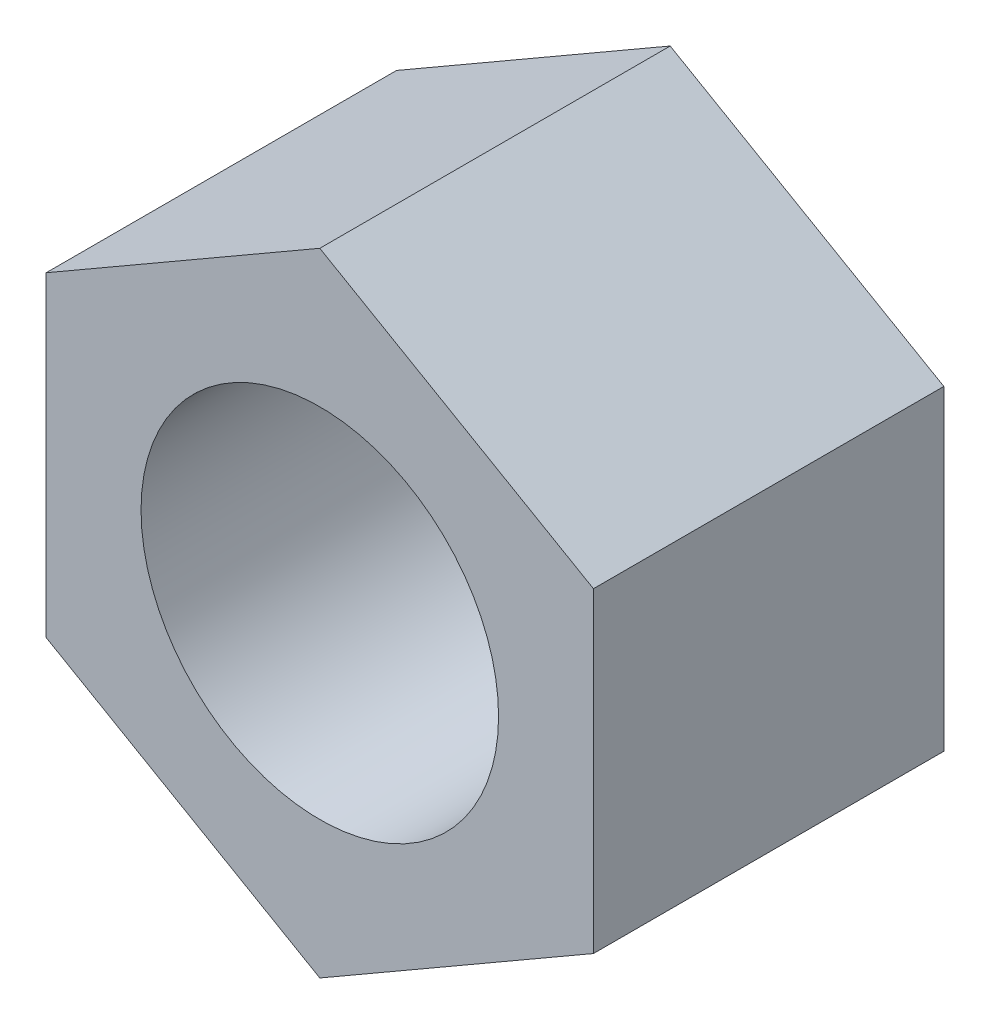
ISO-10303-21;
HEADER;
FILE_DESCRIPTION(('STEP AP214'),'2;1');
FILE_NAME('part.step','',(''),(''),'','','');
FILE_SCHEMA(('AUTOMOTIVE_DESIGN { 1 0 10303 214 1 1 1 1 }'));
ENDSEC;
DATA;
#1=APPLICATION_CONTEXT('core data for automotive mechanical design processes');
#2=APPLICATION_PROTOCOL_DEFINITION('international standard','automotive_design',2000,#1);
#3=PRODUCT_CONTEXT('',#1,'mechanical');
#4=PRODUCT('Part','Part','',(#3));
#5=PRODUCT_RELATED_PRODUCT_CATEGORY('part','',(#4));
#6=PRODUCT_DEFINITION_FORMATION('','',#4);
#7=PRODUCT_DEFINITION_CONTEXT('part definition',#1,'design');
#8=PRODUCT_DEFINITION('design','',#6,#7);
#9=PRODUCT_DEFINITION_SHAPE('','',#8);
#10=(LENGTH_UNIT() NAMED_UNIT(*) SI_UNIT(.MILLI.,.METRE.));
#11=(NAMED_UNIT(*) PLANE_ANGLE_UNIT() SI_UNIT($,.RADIAN.));
#12=(NAMED_UNIT(*) SI_UNIT($,.STERADIAN.) SOLID_ANGLE_UNIT());
#13=UNCERTAINTY_MEASURE_WITH_UNIT(LENGTH_MEASURE(1.E-05),#10,'distance_accuracy_value','');
#14=(GEOMETRIC_REPRESENTATION_CONTEXT(3) GLOBAL_UNCERTAINTY_ASSIGNED_CONTEXT((#13)) GLOBAL_UNIT_ASSIGNED_CONTEXT((#10,
#11,#12)) REPRESENTATION_CONTEXT('',''));
#15=CARTESIAN_POINT('',(0.,0.,0.));
#16=DIRECTION('',(0.,0.,1.));
#17=DIRECTION('',(1.,0.,0.));
#18=AXIS2_PLACEMENT_3D('',#15,#16,#17);
#19=CARTESIAN_POINT('',(0.,0.,56.007));
#20=DIRECTION('',(0.,0.,1.));
#21=DIRECTION('',(1.,0.,0.));
#22=AXIS2_PLACEMENT_3D('',#19,#20,#21);
#23=PLANE('',#22);
#24=DIRECTION('',(0.,1.,0.));
#25=VECTOR('',#24,1.);
#26=CARTESIAN_POINT('',(43.7388,-25.2526079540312,56.007));
#27=LINE('',#26,#25);
#28=CARTESIAN_POINT('',(43.7388,-25.2526079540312,56.007));
#29=VERTEX_POINT('',#28);
#30=CARTESIAN_POINT('',(43.7388,25.2526079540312,56.007));
#31=VERTEX_POINT('',#30);
#32=EDGE_CURVE('E155',#29,#31,#27,.T.);
#33=ORIENTED_EDGE('',*,*,#32,.T.);
#34=DIRECTION('',(-0.866025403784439,0.5,0.));
#35=VECTOR('',#34,1.);
#36=CARTESIAN_POINT('',(43.7388,25.2526079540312,56.007));
#37=LINE('',#36,#35);
#38=CARTESIAN_POINT('',(0.,50.5052159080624,56.007));
#39=VERTEX_POINT('',#38);
#40=EDGE_CURVE('E99',#31,#39,#37,.T.);
#41=ORIENTED_EDGE('',*,*,#40,.T.);
#42=DIRECTION('',(-0.866025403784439,-0.5,0.));
#43=VECTOR('',#42,1.);
#44=CARTESIAN_POINT('',(0.,50.5052159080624,56.007));
#45=LINE('',#44,#43);
#46=CARTESIAN_POINT('',(-43.7388,25.2526079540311,56.007));
#47=VERTEX_POINT('',#46);
#48=EDGE_CURVE('E114',#39,#47,#45,.T.);
#49=ORIENTED_EDGE('',*,*,#48,.T.);
#50=DIRECTION('',(0.,-1.,0.));
#51=VECTOR('',#50,1.);
#52=CARTESIAN_POINT('',(-43.7388,25.2526079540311,56.007));
#53=LINE('',#52,#51);
#54=CARTESIAN_POINT('',(-43.7388,-25.2526079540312,56.007));
#55=VERTEX_POINT('',#54);
#56=EDGE_CURVE('E110',#47,#55,#53,.T.);
#57=ORIENTED_EDGE('',*,*,#56,.T.);
#58=DIRECTION('',(0.866025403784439,-0.5,0.));
#59=VECTOR('',#58,1.);
#60=CARTESIAN_POINT('',(-43.7388,-25.2526079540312,56.007));
#61=LINE('',#60,#59);
#62=CARTESIAN_POINT('',(0.,-50.5052159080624,56.007));
#63=VERTEX_POINT('',#62);
#64=EDGE_CURVE('E112',#55,#63,#61,.T.);
#65=ORIENTED_EDGE('',*,*,#64,.T.);
#66=DIRECTION('',(0.866025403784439,0.5,0.));
#67=VECTOR('',#66,1.);
#68=CARTESIAN_POINT('',(0.,-50.5052159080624,56.007));
#69=LINE('',#68,#67);
#70=EDGE_CURVE('E62',#63,#29,#69,.T.);
#71=ORIENTED_EDGE('',*,*,#70,.T.);
#72=EDGE_LOOP('',(#33,#41,#49,#57,#65,#71));
#73=FACE_BOUND('',#72,.T.);
#74=CARTESIAN_POINT('',(0.,0.,56.007));
#75=DIRECTION('',(0.,0.,1.));
#76=DIRECTION('',(1.,0.,0.));
#77=AXIS2_PLACEMENT_3D('',#74,#75,#76);
#78=CIRCLE('',#77,28.575);
#79=CARTESIAN_POINT('',(28.575,0.,56.007));
#80=VERTEX_POINT('',#79);
#81=EDGE_CURVE('E138',#80,#80,#78,.T.);
#82=ORIENTED_EDGE('',*,*,#81,.F.);
#83=EDGE_LOOP('',(#82));
#84=FACE_BOUND('',#83,.T.);
#85=ADVANCED_FACE('F44',(#73,#84),#23,.T.);
#86=CARTESIAN_POINT('',(0.,0.,0.));
#87=DIRECTION('',(0.,0.,1.));
#88=DIRECTION('',(1.,0.,0.));
#89=AXIS2_PLACEMENT_3D('',#86,#87,#88);
#90=PLANE('',#89);
#91=DIRECTION('',(0.,1.,0.));
#92=VECTOR('',#91,1.);
#93=CARTESIAN_POINT('',(43.7388,-25.2526079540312,0.));
#94=LINE('',#93,#92);
#95=CARTESIAN_POINT('',(43.7388,-25.2526079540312,0.));
#96=VERTEX_POINT('',#95);
#97=CARTESIAN_POINT('',(43.7388,25.2526079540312,0.));
#98=VERTEX_POINT('',#97);
#99=EDGE_CURVE('E134',#96,#98,#94,.T.);
#100=ORIENTED_EDGE('',*,*,#99,.F.);
#101=DIRECTION('',(0.866025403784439,0.5,0.));
#102=VECTOR('',#101,1.);
#103=CARTESIAN_POINT('',(0.,-50.5052159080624,0.));
#104=LINE('',#103,#102);
#105=CARTESIAN_POINT('',(0.,-50.5052159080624,0.));
#106=VERTEX_POINT('',#105);
#107=EDGE_CURVE('E95',#106,#96,#104,.T.);
#108=ORIENTED_EDGE('',*,*,#107,.F.);
#109=DIRECTION('',(0.866025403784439,-0.5,0.));
#110=VECTOR('',#109,1.);
#111=CARTESIAN_POINT('',(-43.7388,-25.2526079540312,0.));
#112=LINE('',#111,#110);
#113=CARTESIAN_POINT('',(-43.7388,-25.2526079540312,0.));
#114=VERTEX_POINT('',#113);
#115=EDGE_CURVE('E88',#114,#106,#112,.T.);
#116=ORIENTED_EDGE('',*,*,#115,.F.);
#117=DIRECTION('',(0.,-1.,0.));
#118=VECTOR('',#117,1.);
#119=CARTESIAN_POINT('',(-43.7388,25.2526079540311,0.));
#120=LINE('',#119,#118);
#121=CARTESIAN_POINT('',(-43.7388,25.2526079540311,0.));
#122=VERTEX_POINT('',#121);
#123=EDGE_CURVE('E125',#122,#114,#120,.T.);
#124=ORIENTED_EDGE('',*,*,#123,.F.);
#125=DIRECTION('',(-0.866025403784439,-0.5,0.));
#126=VECTOR('',#125,1.);
#127=CARTESIAN_POINT('',(0.,50.5052159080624,0.));
#128=LINE('',#127,#126);
#129=CARTESIAN_POINT('',(0.,50.5052159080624,0.));
#130=VERTEX_POINT('',#129);
#131=EDGE_CURVE('E141',#130,#122,#128,.T.);
#132=ORIENTED_EDGE('',*,*,#131,.F.);
#133=DIRECTION('',(-0.866025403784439,0.5,0.));
#134=VECTOR('',#133,1.);
#135=CARTESIAN_POINT('',(43.7388,25.2526079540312,0.));
#136=LINE('',#135,#134);
#137=EDGE_CURVE('E136',#98,#130,#136,.T.);
#138=ORIENTED_EDGE('',*,*,#137,.F.);
#139=EDGE_LOOP('',(#100,#108,#116,#124,#132,#138));
#140=FACE_BOUND('',#139,.T.);
#141=CARTESIAN_POINT('',(0.,0.,0.));
#142=DIRECTION('',(0.,0.,1.));
#143=DIRECTION('',(1.,0.,0.));
#144=AXIS2_PLACEMENT_3D('',#141,#142,#143);
#145=CIRCLE('',#144,28.575);
#146=CARTESIAN_POINT('',(28.575,0.,0.));
#147=VERTEX_POINT('',#146);
#148=EDGE_CURVE('E246',#147,#147,#145,.T.);
#149=ORIENTED_EDGE('',*,*,#148,.T.);
#150=EDGE_LOOP('',(#149));
#151=FACE_BOUND('',#150,.T.);
#152=ADVANCED_FACE('F164',(#140,#151),#90,.F.);
#153=CARTESIAN_POINT('',(43.7388,-25.2526079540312,56.007));
#154=DIRECTION('',(-1.,0.,0.));
#155=DIRECTION('',(0.,-1.,0.));
#156=AXIS2_PLACEMENT_3D('',#153,#154,#155);
#157=PLANE('',#156);
#158=ORIENTED_EDGE('',*,*,#99,.T.);
#159=DIRECTION('',(0.,0.,-1.));
#160=VECTOR('',#159,1.);
#161=CARTESIAN_POINT('',(43.7388,25.2526079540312,56.007));
#162=LINE('',#161,#160);
#163=EDGE_CURVE('E11',#31,#98,#162,.T.);
#164=ORIENTED_EDGE('',*,*,#163,.F.);
#165=ORIENTED_EDGE('',*,*,#32,.F.);
#166=DIRECTION('',(0.,0.,-1.));
#167=VECTOR('',#166,1.);
#168=CARTESIAN_POINT('',(43.7388,-25.2526079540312,56.007));
#169=LINE('',#168,#167);
#170=EDGE_CURVE('E131',#29,#96,#169,.T.);
#171=ORIENTED_EDGE('',*,*,#170,.T.);
#172=EDGE_LOOP('',(#158,#164,#165,#171));
#173=FACE_BOUND('',#172,.T.);
#174=ADVANCED_FACE('F50',(#173),#157,.F.);
#175=CARTESIAN_POINT('',(43.7388,25.2526079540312,56.007));
#176=DIRECTION('',(-0.5,-0.866025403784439,0.));
#177=DIRECTION('',(0.866025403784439,-0.5,0.));
#178=AXIS2_PLACEMENT_3D('',#175,#176,#177);
#179=PLANE('',#178);
#180=ORIENTED_EDGE('',*,*,#137,.T.);
#181=DIRECTION('',(0.,0.,-1.));
#182=VECTOR('',#181,1.);
#183=CARTESIAN_POINT('',(0.,50.5052159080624,56.007));
#184=LINE('',#183,#182);
#185=EDGE_CURVE('E54',#39,#130,#184,.T.);
#186=ORIENTED_EDGE('',*,*,#185,.F.);
#187=ORIENTED_EDGE('',*,*,#40,.F.);
#188=ORIENTED_EDGE('',*,*,#163,.T.);
#189=EDGE_LOOP('',(#180,#186,#187,#188));
#190=FACE_BOUND('',#189,.T.);
#191=ADVANCED_FACE('F189',(#190),#179,.F.);
#192=CARTESIAN_POINT('',(0.,50.5052159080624,56.007));
#193=DIRECTION('',(0.5,-0.866025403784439,0.));
#194=DIRECTION('',(0.866025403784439,0.5,0.));
#195=AXIS2_PLACEMENT_3D('',#192,#193,#194);
#196=PLANE('',#195);
#197=ORIENTED_EDGE('',*,*,#131,.T.);
#198=DIRECTION('',(0.,0.,-1.));
#199=VECTOR('',#198,1.);
#200=CARTESIAN_POINT('',(-43.7388,25.2526079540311,56.007));
#201=LINE('',#200,#199);
#202=EDGE_CURVE('E121',#47,#122,#201,.T.);
#203=ORIENTED_EDGE('',*,*,#202,.F.);
#204=ORIENTED_EDGE('',*,*,#48,.F.);
#205=ORIENTED_EDGE('',*,*,#185,.T.);
#206=EDGE_LOOP('',(#197,#203,#204,#205));
#207=FACE_BOUND('',#206,.T.);
#208=ADVANCED_FACE('F165',(#207),#196,.F.);
#209=CARTESIAN_POINT('',(-43.7388,25.2526079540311,56.007));
#210=DIRECTION('',(1.,0.,0.));
#211=DIRECTION('',(0.,1.,0.));
#212=AXIS2_PLACEMENT_3D('',#209,#210,#211);
#213=PLANE('',#212);
#214=ORIENTED_EDGE('',*,*,#123,.T.);
#215=DIRECTION('',(0.,0.,-1.));
#216=VECTOR('',#215,1.);
#217=CARTESIAN_POINT('',(-43.7388,-25.2526079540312,56.007));
#218=LINE('',#217,#216);
#219=EDGE_CURVE('E118',#55,#114,#218,.T.);
#220=ORIENTED_EDGE('',*,*,#219,.F.);
#221=ORIENTED_EDGE('',*,*,#56,.F.);
#222=ORIENTED_EDGE('',*,*,#202,.T.);
#223=EDGE_LOOP('',(#214,#220,#221,#222));
#224=FACE_BOUND('',#223,.T.);
#225=ADVANCED_FACE('F119',(#224),#213,.F.);
#226=CARTESIAN_POINT('',(-43.7388,-25.2526079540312,56.007));
#227=DIRECTION('',(0.5,0.866025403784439,0.));
#228=DIRECTION('',(-0.866025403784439,0.5,0.));
#229=AXIS2_PLACEMENT_3D('',#226,#227,#228);
#230=PLANE('',#229);
#231=ORIENTED_EDGE('',*,*,#115,.T.);
#232=DIRECTION('',(0.,0.,-1.));
#233=VECTOR('',#232,1.);
#234=CARTESIAN_POINT('',(0.,-50.5052159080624,56.007));
#235=LINE('',#234,#233);
#236=EDGE_CURVE('E123',#63,#106,#235,.T.);
#237=ORIENTED_EDGE('',*,*,#236,.F.);
#238=ORIENTED_EDGE('',*,*,#64,.F.);
#239=ORIENTED_EDGE('',*,*,#219,.T.);
#240=EDGE_LOOP('',(#231,#237,#238,#239));
#241=FACE_BOUND('',#240,.T.);
#242=ADVANCED_FACE('F130',(#241),#230,.F.);
#243=CARTESIAN_POINT('',(0.,-50.5052159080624,56.007));
#244=DIRECTION('',(-0.5,0.866025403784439,0.));
#245=DIRECTION('',(-0.866025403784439,-0.5,0.));
#246=AXIS2_PLACEMENT_3D('',#243,#244,#245);
#247=PLANE('',#246);
#248=ORIENTED_EDGE('',*,*,#107,.T.);
#249=ORIENTED_EDGE('',*,*,#170,.F.);
#250=ORIENTED_EDGE('',*,*,#70,.F.);
#251=ORIENTED_EDGE('',*,*,#236,.T.);
#252=EDGE_LOOP('',(#248,#249,#250,#251));
#253=FACE_BOUND('',#252,.T.);
#254=ADVANCED_FACE('F168',(#253),#247,.F.);
#255=CARTESIAN_POINT('',(0.,0.,56.007));
#256=DIRECTION('',(0.,0.,-1.));
#257=DIRECTION('',(-1.,0.,0.));
#258=AXIS2_PLACEMENT_3D('',#255,#256,#257);
#259=CYLINDRICAL_SURFACE('',#258,28.575);
#260=ORIENTED_EDGE('',*,*,#81,.T.);
#261=EDGE_LOOP('',(#260));
#262=FACE_BOUND('',#261,.T.);
#263=ORIENTED_EDGE('',*,*,#148,.F.);
#264=EDGE_LOOP('',(#263));
#265=FACE_BOUND('',#264,.T.);
#266=ADVANCED_FACE('F175',(#262,#265),#259,.F.);
#267=CLOSED_SHELL('',(#85,#152,#174,#191,#208,#225,#242,#254,#266));
#268=MANIFOLD_SOLID_BREP('B2',#267);
#269=ADVANCED_BREP_SHAPE_REPRESENTATION('',(#18,#268),#14);
#270=SHAPE_DEFINITION_REPRESENTATION(#9,#269);
ENDSEC;
END-ISO-10303-21;
